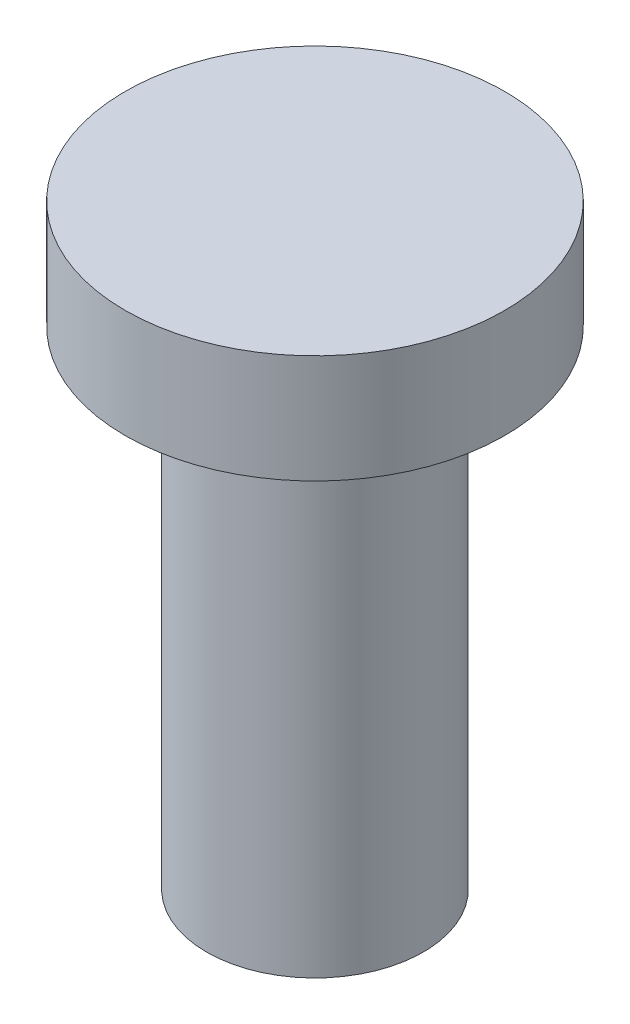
ISO-10303-21;
HEADER;
FILE_DESCRIPTION(('STEP AP214'),'2;1');
FILE_NAME('part.step','',(''),(''),'','','');
FILE_SCHEMA(('AUTOMOTIVE_DESIGN { 1 0 10303 214 1 1 1 1 }'));
ENDSEC;
DATA;
#1=APPLICATION_CONTEXT('core data for automotive mechanical design processes');
#2=APPLICATION_PROTOCOL_DEFINITION('international standard','automotive_design',2000,#1);
#3=PRODUCT_CONTEXT('',#1,'mechanical');
#4=PRODUCT('Part','Part','',(#3));
#5=PRODUCT_RELATED_PRODUCT_CATEGORY('part','',(#4));
#6=PRODUCT_DEFINITION_FORMATION('','',#4);
#7=PRODUCT_DEFINITION_CONTEXT('part definition',#1,'design');
#8=PRODUCT_DEFINITION('design','',#6,#7);
#9=PRODUCT_DEFINITION_SHAPE('','',#8);
#10=(LENGTH_UNIT() NAMED_UNIT(*) SI_UNIT(.MILLI.,.METRE.));
#11=(NAMED_UNIT(*) PLANE_ANGLE_UNIT() SI_UNIT($,.RADIAN.));
#12=(NAMED_UNIT(*) SI_UNIT($,.STERADIAN.) SOLID_ANGLE_UNIT());
#13=UNCERTAINTY_MEASURE_WITH_UNIT(LENGTH_MEASURE(1.E-05),#10,'distance_accuracy_value','');
#14=(GEOMETRIC_REPRESENTATION_CONTEXT(3) GLOBAL_UNCERTAINTY_ASSIGNED_CONTEXT((#13)) GLOBAL_UNIT_ASSIGNED_CONTEXT((#10,
#11,#12)) REPRESENTATION_CONTEXT('',''));
#15=CARTESIAN_POINT('',(0.,0.,0.));
#16=DIRECTION('',(0.,0.,1.));
#17=DIRECTION('',(1.,0.,0.));
#18=AXIS2_PLACEMENT_3D('',#15,#16,#17);
#19=CARTESIAN_POINT('',(0.,0.,0.));
#20=DIRECTION('',(0.,-1.,0.));
#21=DIRECTION('',(0.,0.,-1.));
#22=AXIS2_PLACEMENT_3D('',#19,#20,#21);
#23=PLANE('',#22);
#24=CARTESIAN_POINT('',(0.,0.,0.));
#25=DIRECTION('',(0.,1.,0.));
#26=DIRECTION('',(0.,0.,1.));
#27=AXIS2_PLACEMENT_3D('',#24,#25,#26);
#28=CIRCLE('',#27,10.);
#29=CARTESIAN_POINT('',(0.,0.,10.));
#30=VERTEX_POINT('',#29);
#31=EDGE_CURVE('E10',#30,#30,#28,.T.);
#32=ORIENTED_EDGE('',*,*,#31,.F.);
#33=EDGE_LOOP('',(#32));
#34=FACE_BOUND('',#33,.T.);
#35=ADVANCED_FACE('F30',(#34),#23,.T.);
#36=CARTESIAN_POINT('',(0.,0.,0.));
#37=DIRECTION('',(0.,1.,0.));
#38=DIRECTION('',(0.,0.,1.));
#39=AXIS2_PLACEMENT_3D('',#36,#37,#38);
#40=CYLINDRICAL_SURFACE('',#39,10.);
#41=ORIENTED_EDGE('',*,*,#31,.T.);
#42=EDGE_LOOP('',(#41));
#43=FACE_BOUND('',#42,.T.);
#44=CARTESIAN_POINT('',(0.,45.,0.));
#45=DIRECTION('',(0.,1.,0.));
#46=DIRECTION('',(0.,0.,1.));
#47=AXIS2_PLACEMENT_3D('',#44,#45,#46);
#48=CIRCLE('',#47,10.);
#49=CARTESIAN_POINT('',(0.,45.,10.));
#50=VERTEX_POINT('',#49);
#51=EDGE_CURVE('E36',#50,#50,#48,.T.);
#52=ORIENTED_EDGE('',*,*,#51,.F.);
#53=EDGE_LOOP('',(#52));
#54=FACE_BOUND('',#53,.T.);
#55=ADVANCED_FACE('F62',(#43,#54),#40,.T.);
#56=CARTESIAN_POINT('',(-10.,45.,0.));
#57=DIRECTION('',(0.,-1.,0.));
#58=DIRECTION('',(0.,0.,-1.));
#59=AXIS2_PLACEMENT_3D('',#56,#57,#58);
#60=PLANE('',#59);
#61=ORIENTED_EDGE('',*,*,#51,.T.);
#62=EDGE_LOOP('',(#61));
#63=FACE_BOUND('',#62,.T.);
#64=CARTESIAN_POINT('',(0.,45.,0.));
#65=DIRECTION('',(0.,1.,0.));
#66=DIRECTION('',(0.,0.,1.));
#67=AXIS2_PLACEMENT_3D('',#64,#65,#66);
#68=CIRCLE('',#67,17.5);
#69=CARTESIAN_POINT('',(0.,45.,17.5));
#70=VERTEX_POINT('',#69);
#71=EDGE_CURVE('E40',#70,#70,#68,.T.);
#72=ORIENTED_EDGE('',*,*,#71,.F.);
#73=EDGE_LOOP('',(#72));
#74=FACE_BOUND('',#73,.T.);
#75=ADVANCED_FACE('F54',(#63,#74),#60,.T.);
#76=CARTESIAN_POINT('',(0.,0.,0.));
#77=DIRECTION('',(0.,1.,0.));
#78=DIRECTION('',(0.,0.,1.));
#79=AXIS2_PLACEMENT_3D('',#76,#77,#78);
#80=CYLINDRICAL_SURFACE('',#79,17.5);
#81=ORIENTED_EDGE('',*,*,#71,.T.);
#82=EDGE_LOOP('',(#81));
#83=FACE_BOUND('',#82,.T.);
#84=CARTESIAN_POINT('',(0.,55.,0.));
#85=DIRECTION('',(0.,1.,0.));
#86=DIRECTION('',(0.,0.,1.));
#87=AXIS2_PLACEMENT_3D('',#84,#85,#86);
#88=CIRCLE('',#87,17.5);
#89=CARTESIAN_POINT('',(0.,55.,17.5));
#90=VERTEX_POINT('',#89);
#91=EDGE_CURVE('E44',#90,#90,#88,.T.);
#92=ORIENTED_EDGE('',*,*,#91,.F.);
#93=EDGE_LOOP('',(#92));
#94=FACE_BOUND('',#93,.T.);
#95=ADVANCED_FACE('F52',(#83,#94),#80,.T.);
#96=CARTESIAN_POINT('',(-17.5,55.,0.));
#97=DIRECTION('',(0.,1.,0.));
#98=DIRECTION('',(0.,0.,1.));
#99=AXIS2_PLACEMENT_3D('',#96,#97,#98);
#100=PLANE('',#99);
#101=ORIENTED_EDGE('',*,*,#91,.T.);
#102=EDGE_LOOP('',(#101));
#103=FACE_BOUND('',#102,.T.);
#104=ADVANCED_FACE('F50',(#103),#100,.T.);
#105=CLOSED_SHELL('',(#35,#55,#75,#95,#104));
#106=MANIFOLD_SOLID_BREP('B2',#105);
#107=ADVANCED_BREP_SHAPE_REPRESENTATION('',(#18,#106),#14);
#108=SHAPE_DEFINITION_REPRESENTATION(#9,#107);
ENDSEC;
END-ISO-10303-21;
